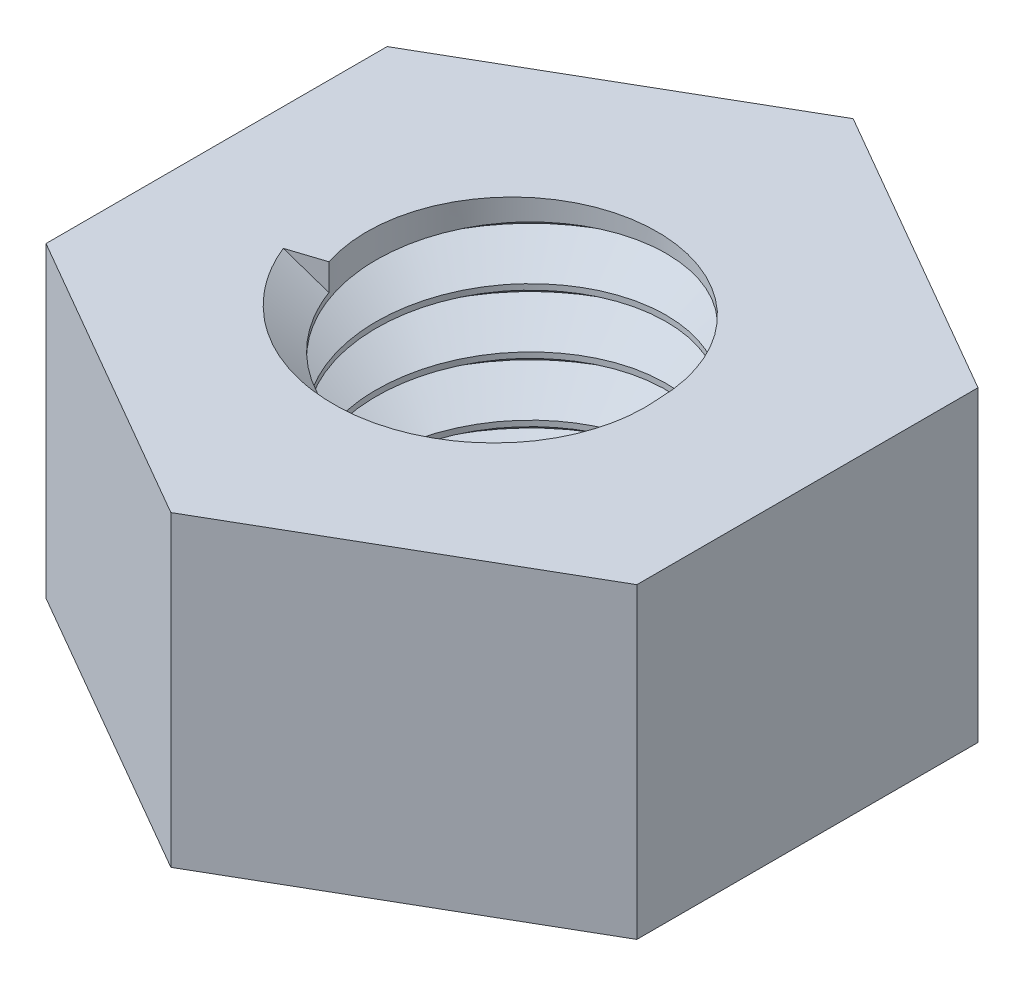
from build123d import *

# Parameters (mm, degrees)
HEXAGONO_DEPTH      = 5.2
TALADRO_PROFILE_R   = 2.45875
ROSCA_M6X1_0_PITCH  = 1
ROSCA_M6X1_0_HEIGHT = 5.2
ROSCA_M6X1_0_RADIUS = 2.4587


with BuildPart() as part:
    # Sk_Hexagono → Hexagono (new body)
    with BuildSketch(Plane(origin=(0, 0, 0), x_dir=(1, 0, 0), z_dir=(0, 1, 0))):
        Polygon((5, -2.886751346), (0, -5.773502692), (-5, -2.886751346), (-5, 2.886751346), (0, 5.773502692), (5, 2.886751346), align=None)
    extrude(amount=HEXAGONO_DEPTH)

    # Taladro: sweep along a curve in space
    with BuildLine() as taladro_path:
        Line((0, -1, 0), (0, 6.2, 0))
    # Taladro profile (on start of the path) → Taladro (sweep, cut)
    with BuildSketch(Plane.ZX.offset(-1)):
        Circle(TALADRO_PROFILE_R)
    sweep(path=taladro_path.line, mode=Mode.SUBTRACT)

    # Rosca_M6x1_0: sweep along a helix
    with BuildLine() as rosca_m6x1_0_path:
        Helix(ROSCA_M6X1_0_PITCH, ROSCA_M6X1_0_HEIGHT, ROSCA_M6X1_0_RADIUS, center=(0, 0, 0), direction=(0, 1, 0), lefthand=True)
    # Sk_Perfil_rosca → Rosca_M6x1_0 (sweep, cut)
    with BuildSketch(Plane(origin=(0, 0, 0), x_dir=(0, 0, -1), z_dir=(1, 0, 0))):
        Polygon((-2.2587, -0.6), (-3.0721, 0), (-2.2587, 0.6), align=None)
    sweep(path=rosca_m6x1_0_path.line, is_frenet=True, mode=Mode.SUBTRACT)


solid = part.part
